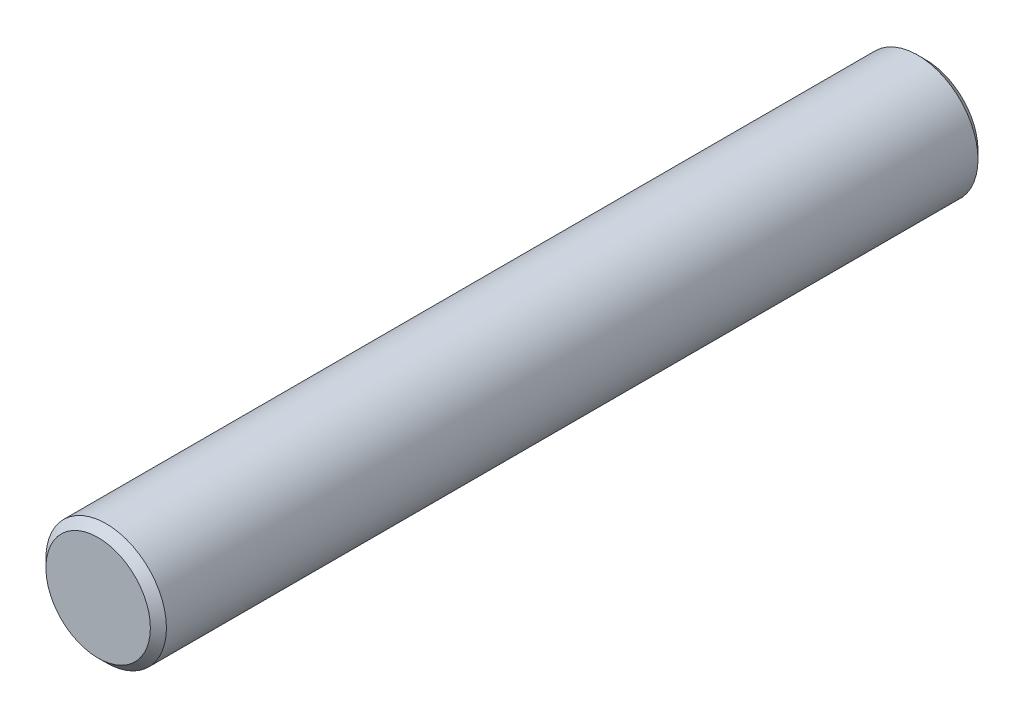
ISO-10303-21;
HEADER;
FILE_DESCRIPTION(('STEP AP214'),'2;1');
FILE_NAME('part.step','',(''),(''),'','','');
FILE_SCHEMA(('AUTOMOTIVE_DESIGN { 1 0 10303 214 1 1 1 1 }'));
ENDSEC;
DATA;
#1=APPLICATION_CONTEXT('core data for automotive mechanical design processes');
#2=APPLICATION_PROTOCOL_DEFINITION('international standard','automotive_design',2000,#1);
#3=PRODUCT_CONTEXT('',#1,'mechanical');
#4=PRODUCT('Part','Part','',(#3));
#5=PRODUCT_RELATED_PRODUCT_CATEGORY('part','',(#4));
#6=PRODUCT_DEFINITION_FORMATION('','',#4);
#7=PRODUCT_DEFINITION_CONTEXT('part definition',#1,'design');
#8=PRODUCT_DEFINITION('design','',#6,#7);
#9=PRODUCT_DEFINITION_SHAPE('','',#8);
#10=(LENGTH_UNIT() NAMED_UNIT(*) SI_UNIT(.MILLI.,.METRE.));
#11=(NAMED_UNIT(*) PLANE_ANGLE_UNIT() SI_UNIT($,.RADIAN.));
#12=(NAMED_UNIT(*) SI_UNIT($,.STERADIAN.) SOLID_ANGLE_UNIT());
#13=UNCERTAINTY_MEASURE_WITH_UNIT(LENGTH_MEASURE(1.E-05),#10,'distance_accuracy_value','');
#14=(GEOMETRIC_REPRESENTATION_CONTEXT(3) GLOBAL_UNCERTAINTY_ASSIGNED_CONTEXT((#13)) GLOBAL_UNIT_ASSIGNED_CONTEXT((#10,
#11,#12)) REPRESENTATION_CONTEXT('',''));
#15=CARTESIAN_POINT('',(0.,0.,0.));
#16=DIRECTION('',(0.,0.,1.));
#17=DIRECTION('',(1.,0.,0.));
#18=AXIS2_PLACEMENT_3D('',#15,#16,#17);
#19=CARTESIAN_POINT('',(0.,0.,10.3));
#20=DIRECTION('',(0.,0.,-1.));
#21=DIRECTION('',(-1.,0.,0.));
#22=AXIS2_PLACEMENT_3D('',#19,#20,#21);
#23=CYLINDRICAL_SURFACE('',#22,0.75);
#24=CARTESIAN_POINT('',(0.,0.,0.0999999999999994));
#25=DIRECTION('',(0.,0.,1.));
#26=DIRECTION('',(1.,0.,0.));
#27=AXIS2_PLACEMENT_3D('',#24,#25,#26);
#28=CIRCLE('',#27,0.75);
#29=CARTESIAN_POINT('',(0.75,0.,0.0999999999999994));
#30=VERTEX_POINT('',#29);
#31=EDGE_CURVE('E45',#30,#30,#28,.T.);
#32=ORIENTED_EDGE('',*,*,#31,.T.);
#33=EDGE_LOOP('',(#32));
#34=FACE_BOUND('',#33,.T.);
#35=CARTESIAN_POINT('',(0.,0.,10.2));
#36=DIRECTION('',(0.,0.,1.));
#37=DIRECTION('',(1.,0.,0.));
#38=AXIS2_PLACEMENT_3D('',#35,#36,#37);
#39=CIRCLE('',#38,0.75);
#40=CARTESIAN_POINT('',(0.75,0.,10.2));
#41=VERTEX_POINT('',#40);
#42=EDGE_CURVE('E49',#41,#41,#39,.F.);
#43=ORIENTED_EDGE('',*,*,#42,.T.);
#44=EDGE_LOOP('',(#43));
#45=FACE_BOUND('',#44,.T.);
#46=ADVANCED_FACE('F33',(#34,#45),#23,.T.);
#47=CARTESIAN_POINT('',(0.,0.,10.3));
#48=DIRECTION('',(0.,0.,1.));
#49=DIRECTION('',(1.,0.,0.));
#50=AXIS2_PLACEMENT_3D('',#47,#48,#49);
#51=PLANE('',#50);
#52=CARTESIAN_POINT('',(0.,0.,10.3));
#53=DIRECTION('',(0.,0.,1.));
#54=DIRECTION('',(1.,0.,0.));
#55=AXIS2_PLACEMENT_3D('',#52,#53,#54);
#56=CIRCLE('',#55,0.650000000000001);
#57=CARTESIAN_POINT('',(0.650000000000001,0.,10.3));
#58=VERTEX_POINT('',#57);
#59=EDGE_CURVE('E10',#58,#58,#56,.T.);
#60=ORIENTED_EDGE('',*,*,#59,.T.);
#61=EDGE_LOOP('',(#60));
#62=FACE_BOUND('',#61,.T.);
#63=ADVANCED_FACE('F65',(#62),#51,.T.);
#64=CARTESIAN_POINT('',(0.,0.,0.));
#65=DIRECTION('',(0.,0.,1.));
#66=DIRECTION('',(1.,0.,0.));
#67=AXIS2_PLACEMENT_3D('',#64,#65,#66);
#68=PLANE('',#67);
#69=CARTESIAN_POINT('',(0.,0.,0.));
#70=DIRECTION('',(0.,0.,1.));
#71=DIRECTION('',(1.,0.,0.));
#72=AXIS2_PLACEMENT_3D('',#69,#70,#71);
#73=CIRCLE('',#72,0.650000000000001);
#74=CARTESIAN_POINT('',(0.650000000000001,0.,0.));
#75=VERTEX_POINT('',#74);
#76=EDGE_CURVE('E41',#75,#75,#73,.F.);
#77=ORIENTED_EDGE('',*,*,#76,.T.);
#78=EDGE_LOOP('',(#77));
#79=FACE_BOUND('',#78,.T.);
#80=ADVANCED_FACE('F62',(#79),#68,.F.);
#81=CARTESIAN_POINT('',(0.,0.,0.0999999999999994));
#82=DIRECTION('',(0.,0.,1.));
#83=DIRECTION('',(1.,0.,0.));
#84=AXIS2_PLACEMENT_3D('',#81,#82,#83);
#85=CONICAL_SURFACE('',#84,0.75,0.785398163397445);
#86=ORIENTED_EDGE('',*,*,#76,.F.);
#87=EDGE_LOOP('',(#86));
#88=FACE_BOUND('',#87,.T.);
#89=ORIENTED_EDGE('',*,*,#31,.F.);
#90=EDGE_LOOP('',(#89));
#91=FACE_BOUND('',#90,.T.);
#92=ADVANCED_FACE('F58',(#88,#91),#85,.T.);
#93=CARTESIAN_POINT('',(0.,0.,10.3));
#94=DIRECTION('',(0.,0.,-1.));
#95=DIRECTION('',(-1.,0.,0.));
#96=AXIS2_PLACEMENT_3D('',#93,#94,#95);
#97=CONICAL_SURFACE('',#96,0.650000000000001,0.785398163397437);
#98=ORIENTED_EDGE('',*,*,#42,.F.);
#99=EDGE_LOOP('',(#98));
#100=FACE_BOUND('',#99,.T.);
#101=ORIENTED_EDGE('',*,*,#59,.F.);
#102=EDGE_LOOP('',(#101));
#103=FACE_BOUND('',#102,.T.);
#104=ADVANCED_FACE('F36',(#100,#103),#97,.T.);
#105=CLOSED_SHELL('',(#46,#63,#80,#92,#104));
#106=MANIFOLD_SOLID_BREP('B2',#105);
#107=ADVANCED_BREP_SHAPE_REPRESENTATION('',(#18,#106),#14);
#108=SHAPE_DEFINITION_REPRESENTATION(#9,#107);
ENDSEC;
END-ISO-10303-21;
